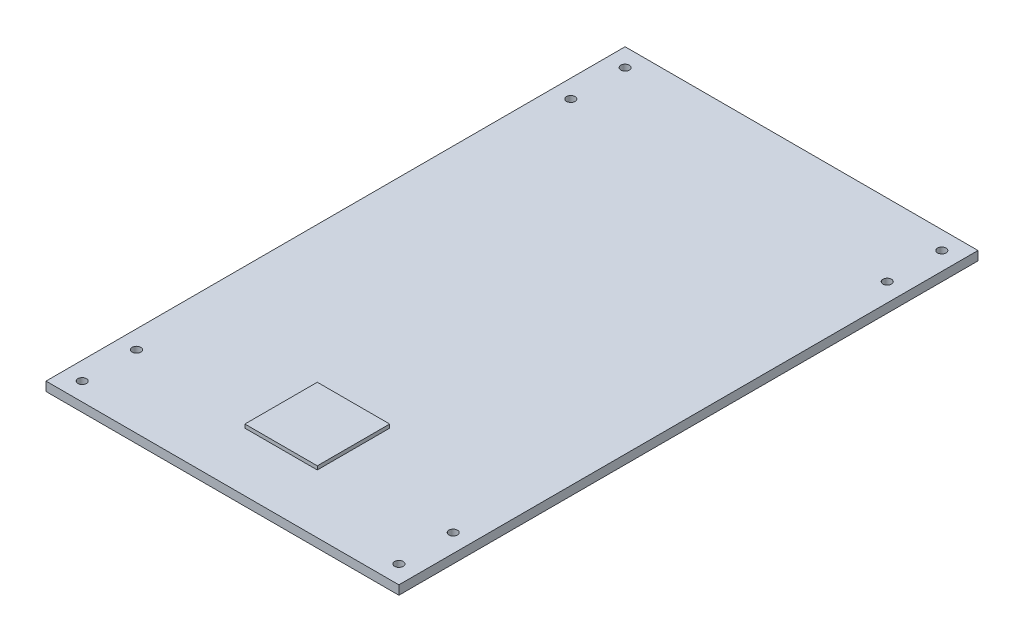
from build123d import *

# Parameters (mm, degrees)
SKETCH1_W             = 123.825
SKETCH1_H             = 203.2
BOSS_EXTRUDE1_DEPTH   = 3.175
F_3_0MM_DOWEL_HOLE1_D = 3
SKETCH4_W             = 25.4
SKETCH4_H             = 25.4
BOSS_EXTRUDE2_DEPTH   = 1.27


with BuildPart() as part:
    # Sketch1 → Boss-Extrude1 (new body)
    with BuildSketch(Plane(origin=(0, 0, 0), x_dir=(1, 0, 0), z_dir=(0, 1, 0))):
        Rectangle(SKETCH1_W, SKETCH1_H)
    extrude(amount=BOSS_EXTRUDE1_DEPTH)

    # 3.0mm Dowel Hole1 (through all)
    with Locations(Plane(origin=(0, 3.175, 0), x_dir=(1, 0, 0), z_dir=(0, 1, 0))):
        with Locations((-55.5625, -95.25), (-55.5625, -76.2), (55.5625, -95.25), (55.5625, -76.2), (-55.5625, 95.25), (-55.5625, 76.2), (55.5625, 95.25), (55.45821723, 76.2)):
            Hole(F_3_0MM_DOWEL_HOLE1_D / 2)

    # Sketch4 → Boss-Extrude2 (add)
    with BuildSketch(Plane(origin=(0, 3.175, 0), x_dir=(1, 0, 0), z_dir=(0, 1, 0))):
        with Locations((0, -68.322500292)):
            Rectangle(SKETCH4_W, SKETCH4_H)
    extrude(amount=BOSS_EXTRUDE2_DEPTH)


solid = part.part
